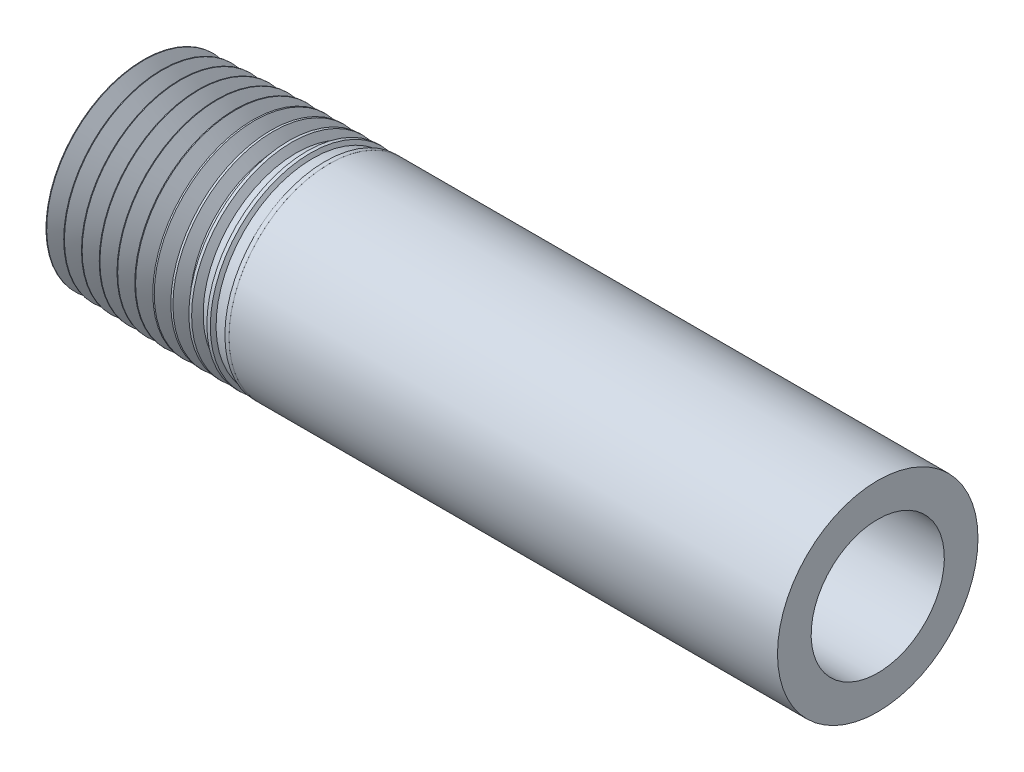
from build123d import *

# Parameters (mm, degrees)
SKETCH2_W      = 14.121178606
SKETCH2_H      = 6.35
SKETCH2_H_2    = 3.4163
SKETCH4_R      = 5.1435
SKETCH4_R_2    = 3.4163
EXTRUDE1_DEPTH = 28.13304


with BuildPart() as part:
    # Sketch1 → Revolve1 (revolve)
    with BuildSketch(Plane.XY):
        Polygon((0, 0), (0, 4.202548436), (0.016953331, 4.234153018), (0.42773912, 4.999944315), (0.463586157, 5.001064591), (0.921387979, 4.262418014), (0.957235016, 4.26353829), (1.368020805, 5.029329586), (1.403867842, 5.030449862), (1.861669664, 4.291803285), (1.897516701, 4.292923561), (2.30830249, 5.058714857), (2.344149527, 5.059835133), (2.801951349, 4.321188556), (2.837798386, 4.322308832), (3.248584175, 5.088100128), (3.284431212, 5.089220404), (3.742233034, 4.350573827), (3.778080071, 4.351694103), (4.18886586, 5.1174854), (4.224712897, 5.118605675), (4.682514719, 4.379959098), (4.718361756, 4.381079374), (5.129147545, 5.146870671), (5.164994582, 5.147990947), (5.622796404, 4.409344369), (5.658643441, 4.410464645), (6.06942923, 5.176255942), (6.105276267, 5.177376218), (6.563078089, 4.43872964), (6.598925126, 4.439849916), (7.009710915, 5.205641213), (7.045557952, 5.206761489), (7.503359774, 4.468114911), (7.539206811, 4.469235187), (7.9499926, 5.235026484), (7.985839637, 5.23614676), (8.443641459, 4.497500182), (8.479488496, 4.498620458), (8.890274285, 5.264411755), (8.926121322, 5.265532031), (9.383923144, 4.526885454), (9.419770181, 4.528005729), (9.83055597, 5.293797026), (9.866403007, 5.294917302), (10.324204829, 4.556270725), (10.360051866, 4.557391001), (10.770837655, 5.323182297), (10.806684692, 5.324302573), (11.264486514, 4.585655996), (11.300333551, 4.586776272), (11.71111934, 5.352567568), (11.746966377, 5.353687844), (12.204768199, 4.615041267), (12.240615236, 4.616161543), (12.651401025, 5.381952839), (12.687248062, 5.383073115), (13.145049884, 4.644426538), (13.180896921, 4.645546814), (13.59168271, 5.411338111), (13.627529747, 5.412458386), (14.085331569, 4.673811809), (14.121178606, 4.674932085), (14.121178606, 0), align=None)
    revolve(axis=Axis((0, 0, 0), (-1, 0, 0)))

    # Sketch5 → Cut-Revolve2 (revolve, cut)
    with BuildSketch(Plane.XY, mode=Mode.PRIVATE) as cut_revolve2_sk:
        Polygon((9.96696, 0), (9.96696, 5.298059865), (14.121178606, 5.427885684), (14.121178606, 0), align=None)
    revolve(cut_revolve2_sk.sketch.rotate(Axis((0, 0, 0), (-1, 0, 0)), 180), axis=Axis((0, 0, 0), (-1, 0, 0)), mode=Mode.SUBTRACT)

    # Sketch2 → Cut-Revolve1 (revolve, cut)
    with BuildSketch(Plane.XY):
        with Locations((7.060589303, 8.3185)):
            Rectangle(SKETCH2_W, SKETCH2_H)
        with Locations((7.060589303, 1.70815)):
            Rectangle(SKETCH2_W, SKETCH2_H_2)
    revolve(axis=Axis((0, 0, 0), (-1, 0, 0)), mode=Mode.SUBTRACT)

    # Sketch3 → Revolve2 (revolve)
    with BuildSketch(Plane.XY):
        Polygon((9.96696, 3.4163), (6.7056, 3.4163), (6.7056, 4.443183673), (9.96696, 5.1435), align=None)
    revolve(axis=Axis((0, 0, 0), (-1, 0, 0)))

    # Sketch4 → Extrude1 (add)
    with BuildSketch(Plane(origin=(9.96696, 0, 0), x_dir=(0, 0, -1), z_dir=(1, 0, 0))):
        with Locations(Location((0, 0, 0), (0, 0, 90))):
            Circle(SKETCH4_R)
        with Locations(Location((0, 0, 0), (0, 0, 90))):
            Circle(SKETCH4_R_2, mode=Mode.SUBTRACT)
    extrude(amount=EXTRUDE1_DEPTH)


solid = part.part
